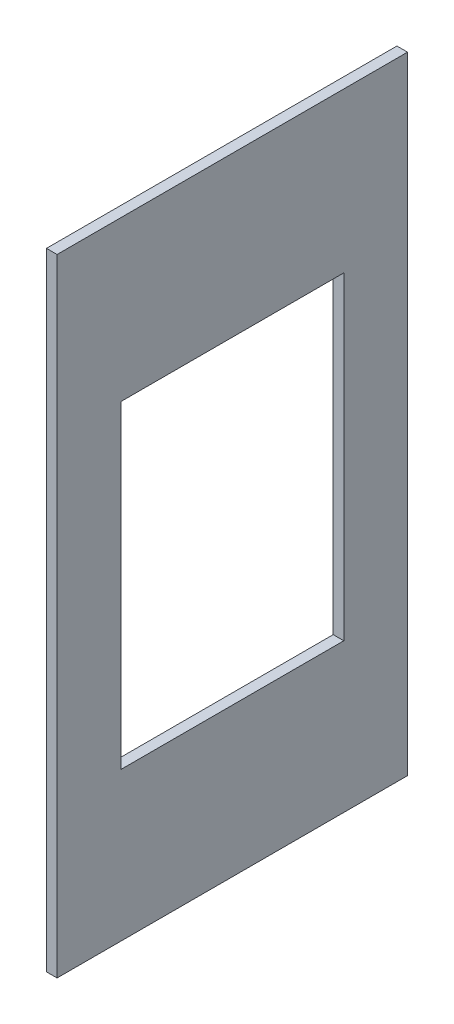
ISO-10303-21;
HEADER;
FILE_DESCRIPTION(('STEP AP214'),'2;1');
FILE_NAME('part.step','',(''),(''),'','','');
FILE_SCHEMA(('AUTOMOTIVE_DESIGN { 1 0 10303 214 1 1 1 1 }'));
ENDSEC;
DATA;
#1=APPLICATION_CONTEXT('core data for automotive mechanical design processes');
#2=APPLICATION_PROTOCOL_DEFINITION('international standard','automotive_design',2000,#1);
#3=PRODUCT_CONTEXT('',#1,'mechanical');
#4=PRODUCT('Part','Part','',(#3));
#5=PRODUCT_RELATED_PRODUCT_CATEGORY('part','',(#4));
#6=PRODUCT_DEFINITION_FORMATION('','',#4);
#7=PRODUCT_DEFINITION_CONTEXT('part definition',#1,'design');
#8=PRODUCT_DEFINITION('design','',#6,#7);
#9=PRODUCT_DEFINITION_SHAPE('','',#8);
#10=(LENGTH_UNIT() NAMED_UNIT(*) SI_UNIT(.MILLI.,.METRE.));
#11=(NAMED_UNIT(*) PLANE_ANGLE_UNIT() SI_UNIT($,.RADIAN.));
#12=(NAMED_UNIT(*) SI_UNIT($,.STERADIAN.) SOLID_ANGLE_UNIT());
#13=UNCERTAINTY_MEASURE_WITH_UNIT(LENGTH_MEASURE(1.E-05),#10,'distance_accuracy_value','');
#14=(GEOMETRIC_REPRESENTATION_CONTEXT(3) GLOBAL_UNCERTAINTY_ASSIGNED_CONTEXT((#13)) GLOBAL_UNIT_ASSIGNED_CONTEXT((#10,
#11,#12)) REPRESENTATION_CONTEXT('',''));
#15=CARTESIAN_POINT('',(0.,0.,0.));
#16=DIRECTION('',(0.,0.,1.));
#17=DIRECTION('',(1.,0.,0.));
#18=AXIS2_PLACEMENT_3D('',#15,#16,#17);
#19=CARTESIAN_POINT('',(12.7,374.65,209.55));
#20=DIRECTION('',(0.,0.,-1.));
#21=DIRECTION('',(0.,1.,0.));
#22=AXIS2_PLACEMENT_3D('',#19,#20,#21);
#23=PLANE('',#22);
#24=DIRECTION('',(0.,-1.,0.));
#25=VECTOR('',#24,1.);
#26=CARTESIAN_POINT('',(0.,374.65,209.55));
#27=LINE('',#26,#25);
#28=CARTESIAN_POINT('',(0.,374.65,209.55));
#29=VERTEX_POINT('',#28);
#30=CARTESIAN_POINT('',(0.,-374.65,209.55));
#31=VERTEX_POINT('',#30);
#32=EDGE_CURVE('E128',#29,#31,#27,.T.);
#33=ORIENTED_EDGE('',*,*,#32,.T.);
#34=DIRECTION('',(-1.,0.,0.));
#35=VECTOR('',#34,1.);
#36=CARTESIAN_POINT('',(12.7,-374.65,209.55));
#37=LINE('',#36,#35);
#38=CARTESIAN_POINT('',(12.7,-374.65,209.55));
#39=VERTEX_POINT('',#38);
#40=EDGE_CURVE('E11',#39,#31,#37,.T.);
#41=ORIENTED_EDGE('',*,*,#40,.F.);
#42=DIRECTION('',(0.,-1.,0.));
#43=VECTOR('',#42,1.);
#44=CARTESIAN_POINT('',(12.7,374.65,209.55));
#45=LINE('',#44,#43);
#46=CARTESIAN_POINT('',(12.7,374.65,209.55));
#47=VERTEX_POINT('',#46);
#48=EDGE_CURVE('E132',#47,#39,#45,.T.);
#49=ORIENTED_EDGE('',*,*,#48,.F.);
#50=DIRECTION('',(-1.,0.,0.));
#51=VECTOR('',#50,1.);
#52=CARTESIAN_POINT('',(12.7,374.65,209.55));
#53=LINE('',#52,#51);
#54=EDGE_CURVE('E142',#47,#29,#53,.T.);
#55=ORIENTED_EDGE('',*,*,#54,.T.);
#56=EDGE_LOOP('',(#33,#41,#49,#55));
#57=FACE_BOUND('',#56,.T.);
#58=ADVANCED_FACE('F31',(#57),#23,.F.);
#59=CARTESIAN_POINT('',(12.7,-374.65,209.55));
#60=DIRECTION('',(0.,1.,0.));
#61=DIRECTION('',(0.,0.,1.));
#62=AXIS2_PLACEMENT_3D('',#59,#60,#61);
#63=PLANE('',#62);
#64=DIRECTION('',(0.,0.,-1.));
#65=VECTOR('',#64,1.);
#66=CARTESIAN_POINT('',(0.,-374.65,209.55));
#67=LINE('',#66,#65);
#68=CARTESIAN_POINT('',(0.,-374.65,-209.55));
#69=VERTEX_POINT('',#68);
#70=EDGE_CURVE('E145',#31,#69,#67,.T.);
#71=ORIENTED_EDGE('',*,*,#70,.T.);
#72=DIRECTION('',(-1.,0.,0.));
#73=VECTOR('',#72,1.);
#74=CARTESIAN_POINT('',(12.7,-374.65,-209.55));
#75=LINE('',#74,#73);
#76=CARTESIAN_POINT('',(12.7,-374.65,-209.55));
#77=VERTEX_POINT('',#76);
#78=EDGE_CURVE('E38',#77,#69,#75,.T.);
#79=ORIENTED_EDGE('',*,*,#78,.F.);
#80=DIRECTION('',(0.,0.,-1.));
#81=VECTOR('',#80,1.);
#82=CARTESIAN_POINT('',(12.7,-374.65,209.55));
#83=LINE('',#82,#81);
#84=EDGE_CURVE('E135',#39,#77,#83,.T.);
#85=ORIENTED_EDGE('',*,*,#84,.F.);
#86=ORIENTED_EDGE('',*,*,#40,.T.);
#87=EDGE_LOOP('',(#71,#79,#85,#86));
#88=FACE_BOUND('',#87,.T.);
#89=ADVANCED_FACE('F173',(#88),#63,.F.);
#90=CARTESIAN_POINT('',(12.7,374.65,-209.55));
#91=DIRECTION('',(0.,0.,1.));
#92=DIRECTION('',(0.,-1.,0.));
#93=AXIS2_PLACEMENT_3D('',#90,#91,#92);
#94=PLANE('',#93);
#95=DIRECTION('',(0.,1.,0.));
#96=VECTOR('',#95,1.);
#97=CARTESIAN_POINT('',(0.,374.65,-209.55));
#98=LINE('',#97,#96);
#99=CARTESIAN_POINT('',(0.,374.65,-209.55));
#100=VERTEX_POINT('',#99);
#101=EDGE_CURVE('E147',#69,#100,#98,.T.);
#102=ORIENTED_EDGE('',*,*,#101,.T.);
#103=DIRECTION('',(-1.,0.,0.));
#104=VECTOR('',#103,1.);
#105=CARTESIAN_POINT('',(12.7,374.65,-209.55));
#106=LINE('',#105,#104);
#107=CARTESIAN_POINT('',(12.7,374.65,-209.55));
#108=VERTEX_POINT('',#107);
#109=EDGE_CURVE('E152',#108,#100,#106,.T.);
#110=ORIENTED_EDGE('',*,*,#109,.F.);
#111=DIRECTION('',(0.,1.,0.));
#112=VECTOR('',#111,1.);
#113=CARTESIAN_POINT('',(12.7,374.65,-209.55));
#114=LINE('',#113,#112);
#115=EDGE_CURVE('E138',#77,#108,#114,.T.);
#116=ORIENTED_EDGE('',*,*,#115,.F.);
#117=ORIENTED_EDGE('',*,*,#78,.T.);
#118=EDGE_LOOP('',(#102,#110,#116,#117));
#119=FACE_BOUND('',#118,.T.);
#120=ADVANCED_FACE('F159',(#119),#94,.F.);
#121=CARTESIAN_POINT('',(12.7,374.65,209.55));
#122=DIRECTION('',(0.,-1.,0.));
#123=DIRECTION('',(0.,0.,-1.));
#124=AXIS2_PLACEMENT_3D('',#121,#122,#123);
#125=PLANE('',#124);
#126=DIRECTION('',(0.,0.,1.));
#127=VECTOR('',#126,1.);
#128=CARTESIAN_POINT('',(0.,374.65,209.55));
#129=LINE('',#128,#127);
#130=EDGE_CURVE('E136',#100,#29,#129,.T.);
#131=ORIENTED_EDGE('',*,*,#130,.T.);
#132=ORIENTED_EDGE('',*,*,#54,.F.);
#133=DIRECTION('',(0.,0.,1.));
#134=VECTOR('',#133,1.);
#135=CARTESIAN_POINT('',(12.7,374.65,209.55));
#136=LINE('',#135,#134);
#137=EDGE_CURVE('E140',#108,#47,#136,.T.);
#138=ORIENTED_EDGE('',*,*,#137,.F.);
#139=ORIENTED_EDGE('',*,*,#109,.T.);
#140=EDGE_LOOP('',(#131,#132,#138,#139));
#141=FACE_BOUND('',#140,.T.);
#142=ADVANCED_FACE('F168',(#141),#125,.F.);
#143=CARTESIAN_POINT('',(12.7,-374.65,209.55));
#144=DIRECTION('',(1.,0.,0.));
#145=DIRECTION('',(0.,0.,-1.));
#146=AXIS2_PLACEMENT_3D('',#143,#144,#145);
#147=PLANE('',#146);
#148=DIRECTION('',(0.,1.,0.));
#149=VECTOR('',#148,1.);
#150=CARTESIAN_POINT('',(12.7,184.15,133.35));
#151=LINE('',#150,#149);
#152=CARTESIAN_POINT('',(12.7,-196.85,133.35));
#153=VERTEX_POINT('',#152);
#154=CARTESIAN_POINT('',(12.7,184.15,133.35));
#155=VERTEX_POINT('',#154);
#156=EDGE_CURVE('E97',#153,#155,#151,.T.);
#157=ORIENTED_EDGE('',*,*,#156,.T.);
#158=DIRECTION('',(0.,0.,-1.));
#159=VECTOR('',#158,1.);
#160=CARTESIAN_POINT('',(12.7,184.15,133.35));
#161=LINE('',#160,#159);
#162=CARTESIAN_POINT('',(12.7,184.15,-133.35));
#163=VERTEX_POINT('',#162);
#164=EDGE_CURVE('E106',#155,#163,#161,.T.);
#165=ORIENTED_EDGE('',*,*,#164,.T.);
#166=DIRECTION('',(0.,-1.,0.));
#167=VECTOR('',#166,1.);
#168=CARTESIAN_POINT('',(12.7,184.15,-133.35));
#169=LINE('',#168,#167);
#170=CARTESIAN_POINT('',(12.7,-196.85,-133.35));
#171=VERTEX_POINT('',#170);
#172=EDGE_CURVE('E45',#163,#171,#169,.T.);
#173=ORIENTED_EDGE('',*,*,#172,.T.);
#174=DIRECTION('',(0.,0.,1.));
#175=VECTOR('',#174,1.);
#176=CARTESIAN_POINT('',(12.7,-196.85,133.35));
#177=LINE('',#176,#175);
#178=EDGE_CURVE('E103',#171,#153,#177,.T.);
#179=ORIENTED_EDGE('',*,*,#178,.T.);
#180=EDGE_LOOP('',(#157,#165,#173,#179));
#181=FACE_BOUND('',#180,.T.);
#182=ORIENTED_EDGE('',*,*,#48,.T.);
#183=ORIENTED_EDGE('',*,*,#84,.T.);
#184=ORIENTED_EDGE('',*,*,#115,.T.);
#185=ORIENTED_EDGE('',*,*,#137,.T.);
#186=EDGE_LOOP('',(#182,#183,#184,#185));
#187=FACE_BOUND('',#186,.T.);
#188=ADVANCED_FACE('F110',(#181,#187),#147,.T.);
#189=CARTESIAN_POINT('',(0.,-374.65,209.55));
#190=DIRECTION('',(1.,0.,0.));
#191=DIRECTION('',(0.,0.,-1.));
#192=AXIS2_PLACEMENT_3D('',#189,#190,#191);
#193=PLANE('',#192);
#194=DIRECTION('',(0.,0.,-1.));
#195=VECTOR('',#194,1.);
#196=CARTESIAN_POINT('',(0.,184.15,133.35));
#197=LINE('',#196,#195);
#198=CARTESIAN_POINT('',(0.,184.15,133.35));
#199=VERTEX_POINT('',#198);
#200=CARTESIAN_POINT('',(0.,184.15,-133.35));
#201=VERTEX_POINT('',#200);
#202=EDGE_CURVE('E122',#199,#201,#197,.T.);
#203=ORIENTED_EDGE('',*,*,#202,.F.);
#204=DIRECTION('',(0.,1.,0.));
#205=VECTOR('',#204,1.);
#206=CARTESIAN_POINT('',(0.,184.15,133.35));
#207=LINE('',#206,#205);
#208=CARTESIAN_POINT('',(0.,-196.85,133.35));
#209=VERTEX_POINT('',#208);
#210=EDGE_CURVE('E53',#209,#199,#207,.T.);
#211=ORIENTED_EDGE('',*,*,#210,.F.);
#212=DIRECTION('',(0.,0.,1.));
#213=VECTOR('',#212,1.);
#214=CARTESIAN_POINT('',(0.,-196.85,133.35));
#215=LINE('',#214,#213);
#216=CARTESIAN_POINT('',(0.,-196.85,-133.35));
#217=VERTEX_POINT('',#216);
#218=EDGE_CURVE('E113',#217,#209,#215,.T.);
#219=ORIENTED_EDGE('',*,*,#218,.F.);
#220=DIRECTION('',(0.,-1.,0.));
#221=VECTOR('',#220,1.);
#222=CARTESIAN_POINT('',(0.,184.15,-133.35));
#223=LINE('',#222,#221);
#224=EDGE_CURVE('E116',#201,#217,#223,.T.);
#225=ORIENTED_EDGE('',*,*,#224,.F.);
#226=EDGE_LOOP('',(#203,#211,#219,#225));
#227=FACE_BOUND('',#226,.T.);
#228=ORIENTED_EDGE('',*,*,#32,.F.);
#229=ORIENTED_EDGE('',*,*,#130,.F.);
#230=ORIENTED_EDGE('',*,*,#101,.F.);
#231=ORIENTED_EDGE('',*,*,#70,.F.);
#232=EDGE_LOOP('',(#228,#229,#230,#231));
#233=FACE_BOUND('',#232,.T.);
#234=ADVANCED_FACE('F165',(#227,#233),#193,.F.);
#235=CARTESIAN_POINT('',(12.7,184.15,133.35));
#236=DIRECTION('',(0.,0.,1.));
#237=DIRECTION('',(0.,-1.,0.));
#238=AXIS2_PLACEMENT_3D('',#235,#236,#237);
#239=PLANE('',#238);
#240=ORIENTED_EDGE('',*,*,#210,.T.);
#241=DIRECTION('',(-1.,0.,0.));
#242=VECTOR('',#241,1.);
#243=CARTESIAN_POINT('',(12.7,184.15,133.35));
#244=LINE('',#243,#242);
#245=EDGE_CURVE('E93',#155,#199,#244,.T.);
#246=ORIENTED_EDGE('',*,*,#245,.F.);
#247=ORIENTED_EDGE('',*,*,#156,.F.);
#248=DIRECTION('',(-1.,0.,0.));
#249=VECTOR('',#248,1.);
#250=CARTESIAN_POINT('',(12.7,-196.85,133.35));
#251=LINE('',#250,#249);
#252=EDGE_CURVE('E126',#153,#209,#251,.T.);
#253=ORIENTED_EDGE('',*,*,#252,.T.);
#254=EDGE_LOOP('',(#240,#246,#247,#253));
#255=FACE_BOUND('',#254,.T.);
#256=ADVANCED_FACE('F95',(#255),#239,.F.);
#257=CARTESIAN_POINT('',(12.7,-196.85,133.35));
#258=DIRECTION('',(0.,-1.,0.));
#259=DIRECTION('',(0.,0.,-1.));
#260=AXIS2_PLACEMENT_3D('',#257,#258,#259);
#261=PLANE('',#260);
#262=ORIENTED_EDGE('',*,*,#218,.T.);
#263=ORIENTED_EDGE('',*,*,#252,.F.);
#264=ORIENTED_EDGE('',*,*,#178,.F.);
#265=DIRECTION('',(-1.,0.,0.));
#266=VECTOR('',#265,1.);
#267=CARTESIAN_POINT('',(12.7,-196.85,-133.35));
#268=LINE('',#267,#266);
#269=EDGE_CURVE('E129',#171,#217,#268,.T.);
#270=ORIENTED_EDGE('',*,*,#269,.T.);
#271=EDGE_LOOP('',(#262,#263,#264,#270));
#272=FACE_BOUND('',#271,.T.);
#273=ADVANCED_FACE('F190',(#272),#261,.F.);
#274=CARTESIAN_POINT('',(12.7,184.15,-133.35));
#275=DIRECTION('',(0.,0.,-1.));
#276=DIRECTION('',(0.,1.,0.));
#277=AXIS2_PLACEMENT_3D('',#274,#275,#276);
#278=PLANE('',#277);
#279=ORIENTED_EDGE('',*,*,#224,.T.);
#280=ORIENTED_EDGE('',*,*,#269,.F.);
#281=ORIENTED_EDGE('',*,*,#172,.F.);
#282=DIRECTION('',(-1.,0.,0.));
#283=VECTOR('',#282,1.);
#284=CARTESIAN_POINT('',(12.7,184.15,-133.35));
#285=LINE('',#284,#283);
#286=EDGE_CURVE('E102',#163,#201,#285,.T.);
#287=ORIENTED_EDGE('',*,*,#286,.T.);
#288=EDGE_LOOP('',(#279,#280,#281,#287));
#289=FACE_BOUND('',#288,.T.);
#290=ADVANCED_FACE('F193',(#289),#278,.F.);
#291=CARTESIAN_POINT('',(12.7,184.15,133.35));
#292=DIRECTION('',(0.,1.,0.));
#293=DIRECTION('',(0.,0.,1.));
#294=AXIS2_PLACEMENT_3D('',#291,#292,#293);
#295=PLANE('',#294);
#296=ORIENTED_EDGE('',*,*,#202,.T.);
#297=ORIENTED_EDGE('',*,*,#286,.F.);
#298=ORIENTED_EDGE('',*,*,#164,.F.);
#299=ORIENTED_EDGE('',*,*,#245,.T.);
#300=EDGE_LOOP('',(#296,#297,#298,#299));
#301=FACE_BOUND('',#300,.T.);
#302=ADVANCED_FACE('F107',(#301),#295,.F.);
#303=CLOSED_SHELL('',(#58,#89,#120,#142,#188,#234,#256,#273,#290,#302));
#304=MANIFOLD_SOLID_BREP('B2',#303);
#305=ADVANCED_BREP_SHAPE_REPRESENTATION('',(#18,#304),#14);
#306=SHAPE_DEFINITION_REPRESENTATION(#9,#305);
ENDSEC;
END-ISO-10303-21;
